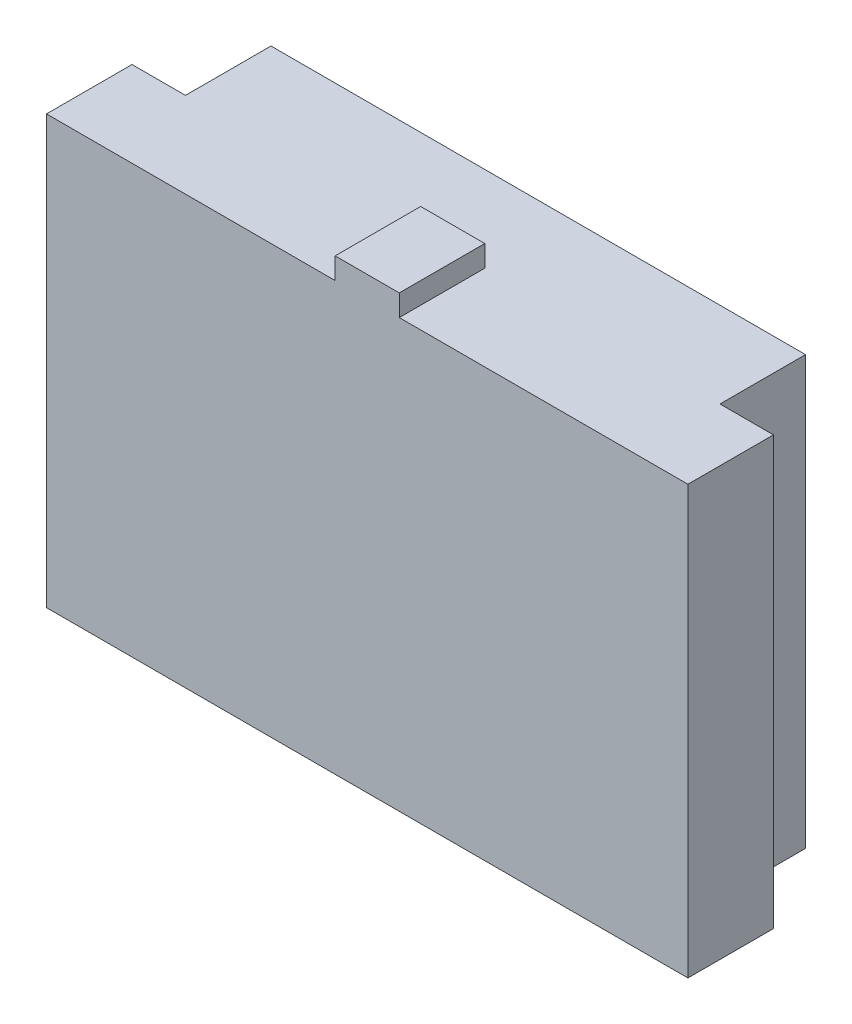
ISO-10303-21;
HEADER;
FILE_DESCRIPTION(('STEP AP214'),'2;1');
FILE_NAME('part.step','',(''),(''),'','','');
FILE_SCHEMA(('AUTOMOTIVE_DESIGN { 1 0 10303 214 1 1 1 1 }'));
ENDSEC;
DATA;
#1=APPLICATION_CONTEXT('core data for automotive mechanical design processes');
#2=APPLICATION_PROTOCOL_DEFINITION('international standard','automotive_design',2000,#1);
#3=PRODUCT_CONTEXT('',#1,'mechanical');
#4=PRODUCT('Part','Part','',(#3));
#5=PRODUCT_RELATED_PRODUCT_CATEGORY('part','',(#4));
#6=PRODUCT_DEFINITION_FORMATION('','',#4);
#7=PRODUCT_DEFINITION_CONTEXT('part definition',#1,'design');
#8=PRODUCT_DEFINITION('design','',#6,#7);
#9=PRODUCT_DEFINITION_SHAPE('','',#8);
#10=(LENGTH_UNIT() NAMED_UNIT(*) SI_UNIT(.MILLI.,.METRE.));
#11=(NAMED_UNIT(*) PLANE_ANGLE_UNIT() SI_UNIT($,.RADIAN.));
#12=(NAMED_UNIT(*) SI_UNIT($,.STERADIAN.) SOLID_ANGLE_UNIT());
#13=UNCERTAINTY_MEASURE_WITH_UNIT(LENGTH_MEASURE(1.E-05),#10,'distance_accuracy_value','');
#14=(GEOMETRIC_REPRESENTATION_CONTEXT(3) GLOBAL_UNCERTAINTY_ASSIGNED_CONTEXT((#13)) GLOBAL_UNIT_ASSIGNED_CONTEXT((#10,
#11,#12)) REPRESENTATION_CONTEXT('',''));
#15=CARTESIAN_POINT('',(0.,0.,0.));
#16=DIRECTION('',(0.,0.,1.));
#17=DIRECTION('',(1.,0.,0.));
#18=AXIS2_PLACEMENT_3D('',#15,#16,#17);
#19=CARTESIAN_POINT('',(0.,0.,0.));
#20=DIRECTION('',(0.,0.,-1.));
#21=DIRECTION('',(-1.,0.,0.));
#22=AXIS2_PLACEMENT_3D('',#19,#20,#21);
#23=PLANE('',#22);
#24=DIRECTION('',(0.,-1.,0.));
#25=VECTOR('',#24,1.);
#26=CARTESIAN_POINT('',(55.,40.,0.));
#27=LINE('',#26,#25);
#28=CARTESIAN_POINT('',(55.,40.,0.));
#29=VERTEX_POINT('',#28);
#30=CARTESIAN_POINT('',(55.,0.,0.));
#31=VERTEX_POINT('',#30);
#32=EDGE_CURVE('E49',#29,#31,#27,.T.);
#33=ORIENTED_EDGE('',*,*,#32,.F.);
#34=DIRECTION('',(-1.,0.,0.));
#35=VECTOR('',#34,1.);
#36=CARTESIAN_POINT('',(60.,40.,0.));
#37=LINE('',#36,#35);
#38=CARTESIAN_POINT('',(60.,40.,0.));
#39=VERTEX_POINT('',#38);
#40=EDGE_CURVE('E172',#39,#29,#37,.T.);
#41=ORIENTED_EDGE('',*,*,#40,.F.);
#42=DIRECTION('',(0.,1.,0.));
#43=VECTOR('',#42,1.);
#44=CARTESIAN_POINT('',(60.,40.,0.));
#45=LINE('',#44,#43);
#46=CARTESIAN_POINT('',(60.,0.,0.));
#47=VERTEX_POINT('',#46);
#48=EDGE_CURVE('E170',#47,#39,#45,.T.);
#49=ORIENTED_EDGE('',*,*,#48,.F.);
#50=DIRECTION('',(1.,0.,0.));
#51=VECTOR('',#50,1.);
#52=CARTESIAN_POINT('',(0.,0.,0.));
#53=LINE('',#52,#51);
#54=EDGE_CURVE('E54',#31,#47,#53,.T.);
#55=ORIENTED_EDGE('',*,*,#54,.F.);
#56=EDGE_LOOP('',(#33,#41,#49,#55));
#57=FACE_BOUND('',#56,.T.);
#58=ADVANCED_FACE('F33',(#57),#23,.T.);
#59=DIRECTION('',(1.,0.,0.));
#60=VECTOR('',#59,1.);
#61=CARTESIAN_POINT('',(55.,40.,0.));
#62=LINE('',#61,#60);
#63=CARTESIAN_POINT('',(27.,40.,0.));
#64=VERTEX_POINT('',#63);
#65=CARTESIAN_POINT('',(33.,40.,0.));
#66=VERTEX_POINT('',#65);
#67=EDGE_CURVE('E11',#64,#66,#62,.T.);
#68=ORIENTED_EDGE('',*,*,#67,.F.);
#69=DIRECTION('',(0.,-1.,0.));
#70=VECTOR('',#69,1.);
#71=CARTESIAN_POINT('',(27.,42.,0.));
#72=LINE('',#71,#70);
#73=CARTESIAN_POINT('',(27.,42.,0.));
#74=VERTEX_POINT('',#73);
#75=EDGE_CURVE('E178',#74,#64,#72,.T.);
#76=ORIENTED_EDGE('',*,*,#75,.F.);
#77=DIRECTION('',(-1.,0.,0.));
#78=VECTOR('',#77,1.);
#79=CARTESIAN_POINT('',(33.,42.,0.));
#80=LINE('',#79,#78);
#81=CARTESIAN_POINT('',(33.,42.,0.));
#82=VERTEX_POINT('',#81);
#83=EDGE_CURVE('E176',#82,#74,#80,.T.);
#84=ORIENTED_EDGE('',*,*,#83,.F.);
#85=DIRECTION('',(0.,1.,0.));
#86=VECTOR('',#85,1.);
#87=CARTESIAN_POINT('',(33.,42.,0.));
#88=LINE('',#87,#86);
#89=EDGE_CURVE('E174',#66,#82,#88,.T.);
#90=ORIENTED_EDGE('',*,*,#89,.F.);
#91=EDGE_LOOP('',(#68,#76,#84,#90));
#92=FACE_BOUND('',#91,.T.);
#93=ADVANCED_FACE('F234',(#92),#23,.T.);
#94=CARTESIAN_POINT('',(0.,0.,8.));
#95=DIRECTION('',(0.,1.,0.));
#96=DIRECTION('',(0.,0.,1.));
#97=AXIS2_PLACEMENT_3D('',#94,#95,#96);
#98=PLANE('',#97);
#99=CARTESIAN_POINT('',(0.,0.,0.));
#100=VERTEX_POINT('',#99);
#101=CARTESIAN_POINT('',(5.,0.,0.));
#102=VERTEX_POINT('',#101);
#103=EDGE_CURVE('E145',#100,#102,#53,.T.);
#104=ORIENTED_EDGE('',*,*,#103,.T.);
#105=DIRECTION('',(0.,0.,1.));
#106=VECTOR('',#105,1.);
#107=CARTESIAN_POINT('',(4.99999999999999,0.,-8.));
#108=LINE('',#107,#106);
#109=CARTESIAN_POINT('',(4.99999999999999,0.,-8.));
#110=VERTEX_POINT('',#109);
#111=EDGE_CURVE('E128',#110,#102,#108,.T.);
#112=ORIENTED_EDGE('',*,*,#111,.F.);
#113=DIRECTION('',(-1.,0.,0.));
#114=VECTOR('',#113,1.);
#115=CARTESIAN_POINT('',(55.,0.,-8.));
#116=LINE('',#115,#114);
#117=CARTESIAN_POINT('',(55.,0.,-8.));
#118=VERTEX_POINT('',#117);
#119=EDGE_CURVE('E122',#118,#110,#116,.T.);
#120=ORIENTED_EDGE('',*,*,#119,.F.);
#121=DIRECTION('',(0.,0.,1.));
#122=VECTOR('',#121,1.);
#123=CARTESIAN_POINT('',(55.,0.,-8.));
#124=LINE('',#123,#122);
#125=EDGE_CURVE('E126',#118,#31,#124,.T.);
#126=ORIENTED_EDGE('',*,*,#125,.T.);
#127=ORIENTED_EDGE('',*,*,#54,.T.);
#128=DIRECTION('',(0.,0.,-1.));
#129=VECTOR('',#128,1.);
#130=CARTESIAN_POINT('',(60.,0.,8.));
#131=LINE('',#130,#129);
#132=CARTESIAN_POINT('',(60.,0.,8.));
#133=VERTEX_POINT('',#132);
#134=EDGE_CURVE('E37',#133,#47,#131,.T.);
#135=ORIENTED_EDGE('',*,*,#134,.F.);
#136=DIRECTION('',(1.,0.,0.));
#137=VECTOR('',#136,1.);
#138=CARTESIAN_POINT('',(0.,0.,8.));
#139=LINE('',#138,#137);
#140=CARTESIAN_POINT('',(0.,0.,8.));
#141=VERTEX_POINT('',#140);
#142=EDGE_CURVE('E151',#141,#133,#139,.T.);
#143=ORIENTED_EDGE('',*,*,#142,.F.);
#144=DIRECTION('',(0.,0.,-1.));
#145=VECTOR('',#144,1.);
#146=CARTESIAN_POINT('',(0.,0.,8.));
#147=LINE('',#146,#145);
#148=EDGE_CURVE('E168',#141,#100,#147,.T.);
#149=ORIENTED_EDGE('',*,*,#148,.T.);
#150=EDGE_LOOP('',(#104,#112,#120,#126,#127,#135,#143,#149));
#151=FACE_BOUND('',#150,.T.);
#152=ADVANCED_FACE('F35',(#151),#98,.F.);
#153=CARTESIAN_POINT('',(60.,40.,8.));
#154=DIRECTION('',(-1.,0.,0.));
#155=DIRECTION('',(0.,-1.,0.));
#156=AXIS2_PLACEMENT_3D('',#153,#154,#155);
#157=PLANE('',#156);
#158=ORIENTED_EDGE('',*,*,#48,.T.);
#159=DIRECTION('',(0.,0.,-1.));
#160=VECTOR('',#159,1.);
#161=CARTESIAN_POINT('',(60.,40.,8.));
#162=LINE('',#161,#160);
#163=CARTESIAN_POINT('',(60.,40.,8.));
#164=VERTEX_POINT('',#163);
#165=EDGE_CURVE('E199',#164,#39,#162,.T.);
#166=ORIENTED_EDGE('',*,*,#165,.F.);
#167=DIRECTION('',(0.,1.,0.));
#168=VECTOR('',#167,1.);
#169=CARTESIAN_POINT('',(60.,40.,8.));
#170=LINE('',#169,#168);
#171=EDGE_CURVE('E154',#133,#164,#170,.T.);
#172=ORIENTED_EDGE('',*,*,#171,.F.);
#173=ORIENTED_EDGE('',*,*,#134,.T.);
#174=EDGE_LOOP('',(#158,#166,#172,#173));
#175=FACE_BOUND('',#174,.T.);
#176=ADVANCED_FACE('F207',(#175),#157,.F.);
#177=CARTESIAN_POINT('',(33.,42.,8.));
#178=DIRECTION('',(-1.,0.,0.));
#179=DIRECTION('',(0.,-1.,0.));
#180=AXIS2_PLACEMENT_3D('',#177,#178,#179);
#181=PLANE('',#180);
#182=ORIENTED_EDGE('',*,*,#89,.T.);
#183=DIRECTION('',(0.,0.,-1.));
#184=VECTOR('',#183,1.);
#185=CARTESIAN_POINT('',(33.,42.,8.));
#186=LINE('',#185,#184);
#187=CARTESIAN_POINT('',(33.,42.,8.));
#188=VERTEX_POINT('',#187);
#189=EDGE_CURVE('E195',#188,#82,#186,.T.);
#190=ORIENTED_EDGE('',*,*,#189,.F.);
#191=DIRECTION('',(0.,1.,0.));
#192=VECTOR('',#191,1.);
#193=CARTESIAN_POINT('',(33.,42.,8.));
#194=LINE('',#193,#192);
#195=CARTESIAN_POINT('',(33.,40.,8.));
#196=VERTEX_POINT('',#195);
#197=EDGE_CURVE('E159',#196,#188,#194,.T.);
#198=ORIENTED_EDGE('',*,*,#197,.F.);
#199=DIRECTION('',(0.,0.,-1.));
#200=VECTOR('',#199,1.);
#201=CARTESIAN_POINT('',(33.,40.,8.));
#202=LINE('',#201,#200);
#203=EDGE_CURVE('E198',#196,#66,#202,.T.);
#204=ORIENTED_EDGE('',*,*,#203,.T.);
#205=EDGE_LOOP('',(#182,#190,#198,#204));
#206=FACE_BOUND('',#205,.T.);
#207=ADVANCED_FACE('F264',(#206),#181,.F.);
#208=CARTESIAN_POINT('',(33.,42.,8.));
#209=DIRECTION('',(0.,-1.,0.));
#210=DIRECTION('',(0.,0.,-1.));
#211=AXIS2_PLACEMENT_3D('',#208,#209,#210);
#212=PLANE('',#211);
#213=ORIENTED_EDGE('',*,*,#83,.T.);
#214=DIRECTION('',(0.,0.,-1.));
#215=VECTOR('',#214,1.);
#216=CARTESIAN_POINT('',(27.,42.,8.));
#217=LINE('',#216,#215);
#218=CARTESIAN_POINT('',(27.,42.,8.));
#219=VERTEX_POINT('',#218);
#220=EDGE_CURVE('E192',#219,#74,#217,.T.);
#221=ORIENTED_EDGE('',*,*,#220,.F.);
#222=DIRECTION('',(-1.,0.,0.));
#223=VECTOR('',#222,1.);
#224=CARTESIAN_POINT('',(33.,42.,8.));
#225=LINE('',#224,#223);
#226=EDGE_CURVE('E161',#188,#219,#225,.T.);
#227=ORIENTED_EDGE('',*,*,#226,.F.);
#228=ORIENTED_EDGE('',*,*,#189,.T.);
#229=EDGE_LOOP('',(#213,#221,#227,#228));
#230=FACE_BOUND('',#229,.T.);
#231=ADVANCED_FACE('F262',(#230),#212,.F.);
#232=CARTESIAN_POINT('',(27.,42.,8.));
#233=DIRECTION('',(1.,0.,0.));
#234=DIRECTION('',(0.,1.,0.));
#235=AXIS2_PLACEMENT_3D('',#232,#233,#234);
#236=PLANE('',#235);
#237=ORIENTED_EDGE('',*,*,#75,.T.);
#238=DIRECTION('',(0.,0.,-1.));
#239=VECTOR('',#238,1.);
#240=CARTESIAN_POINT('',(27.,40.,8.));
#241=LINE('',#240,#239);
#242=CARTESIAN_POINT('',(27.,40.,8.));
#243=VERTEX_POINT('',#242);
#244=EDGE_CURVE('E189',#243,#64,#241,.T.);
#245=ORIENTED_EDGE('',*,*,#244,.F.);
#246=DIRECTION('',(0.,-1.,0.));
#247=VECTOR('',#246,1.);
#248=CARTESIAN_POINT('',(27.,42.,8.));
#249=LINE('',#248,#247);
#250=EDGE_CURVE('E163',#219,#243,#249,.T.);
#251=ORIENTED_EDGE('',*,*,#250,.F.);
#252=ORIENTED_EDGE('',*,*,#220,.T.);
#253=EDGE_LOOP('',(#237,#245,#251,#252));
#254=FACE_BOUND('',#253,.T.);
#255=ADVANCED_FACE('F255',(#254),#236,.F.);
#256=CARTESIAN_POINT('',(0.,40.,8.));
#257=DIRECTION('',(0.,-1.,0.));
#258=DIRECTION('',(0.,0.,-1.));
#259=AXIS2_PLACEMENT_3D('',#256,#257,#258);
#260=PLANE('',#259);
#261=ORIENTED_EDGE('',*,*,#244,.T.);
#262=ORIENTED_EDGE('',*,*,#67,.T.);
#263=ORIENTED_EDGE('',*,*,#203,.F.);
#264=DIRECTION('',(-1.,0.,0.));
#265=VECTOR('',#264,1.);
#266=CARTESIAN_POINT('',(60.,40.,8.));
#267=LINE('',#266,#265);
#268=EDGE_CURVE('E157',#164,#196,#267,.T.);
#269=ORIENTED_EDGE('',*,*,#268,.F.);
#270=ORIENTED_EDGE('',*,*,#165,.T.);
#271=ORIENTED_EDGE('',*,*,#40,.T.);
#272=DIRECTION('',(0.,0.,1.));
#273=VECTOR('',#272,1.);
#274=CARTESIAN_POINT('',(55.,40.,-8.));
#275=LINE('',#274,#273);
#276=CARTESIAN_POINT('',(55.,40.,-8.));
#277=VERTEX_POINT('',#276);
#278=EDGE_CURVE('E210',#277,#29,#275,.T.);
#279=ORIENTED_EDGE('',*,*,#278,.F.);
#280=DIRECTION('',(1.,0.,0.));
#281=VECTOR('',#280,1.);
#282=CARTESIAN_POINT('',(55.,40.,-8.));
#283=LINE('',#282,#281);
#284=CARTESIAN_POINT('',(5.,40.,-8.));
#285=VERTEX_POINT('',#284);
#286=EDGE_CURVE('E137',#285,#277,#283,.T.);
#287=ORIENTED_EDGE('',*,*,#286,.F.);
#288=DIRECTION('',(0.,0.,1.));
#289=VECTOR('',#288,1.);
#290=CARTESIAN_POINT('',(5.,40.,-8.));
#291=LINE('',#290,#289);
#292=CARTESIAN_POINT('',(5.,40.,0.));
#293=VERTEX_POINT('',#292);
#294=EDGE_CURVE('E147',#285,#293,#291,.T.);
#295=ORIENTED_EDGE('',*,*,#294,.T.);
#296=DIRECTION('',(-1.,0.,0.));
#297=VECTOR('',#296,1.);
#298=CARTESIAN_POINT('',(0.,40.,0.));
#299=LINE('',#298,#297);
#300=CARTESIAN_POINT('',(0.,40.,0.));
#301=VERTEX_POINT('',#300);
#302=EDGE_CURVE('E181',#293,#301,#299,.T.);
#303=ORIENTED_EDGE('',*,*,#302,.T.);
#304=DIRECTION('',(0.,0.,-1.));
#305=VECTOR('',#304,1.);
#306=CARTESIAN_POINT('',(0.,40.,8.));
#307=LINE('',#306,#305);
#308=CARTESIAN_POINT('',(0.,40.,8.));
#309=VERTEX_POINT('',#308);
#310=EDGE_CURVE('E186',#309,#301,#307,.T.);
#311=ORIENTED_EDGE('',*,*,#310,.F.);
#312=DIRECTION('',(-1.,0.,0.));
#313=VECTOR('',#312,1.);
#314=CARTESIAN_POINT('',(0.,40.,8.));
#315=LINE('',#314,#313);
#316=EDGE_CURVE('E165',#243,#309,#315,.T.);
#317=ORIENTED_EDGE('',*,*,#316,.F.);
#318=EDGE_LOOP('',(#261,#262,#263,#269,#270,#271,#279,#287,#295,#303,#311,#317));
#319=FACE_BOUND('',#318,.T.);
#320=ADVANCED_FACE('F209',(#319),#260,.F.);
#321=CARTESIAN_POINT('',(0.,40.,8.));
#322=DIRECTION('',(1.,0.,0.));
#323=DIRECTION('',(0.,1.,0.));
#324=AXIS2_PLACEMENT_3D('',#321,#322,#323);
#325=PLANE('',#324);
#326=DIRECTION('',(0.,-1.,0.));
#327=VECTOR('',#326,1.);
#328=CARTESIAN_POINT('',(0.,40.,0.));
#329=LINE('',#328,#327);
#330=EDGE_CURVE('E155',#301,#100,#329,.T.);
#331=ORIENTED_EDGE('',*,*,#330,.T.);
#332=ORIENTED_EDGE('',*,*,#148,.F.);
#333=DIRECTION('',(0.,-1.,0.));
#334=VECTOR('',#333,1.);
#335=CARTESIAN_POINT('',(0.,40.,8.));
#336=LINE('',#335,#334);
#337=EDGE_CURVE('E167',#309,#141,#336,.T.);
#338=ORIENTED_EDGE('',*,*,#337,.F.);
#339=ORIENTED_EDGE('',*,*,#310,.T.);
#340=EDGE_LOOP('',(#331,#332,#338,#339));
#341=FACE_BOUND('',#340,.T.);
#342=ADVANCED_FACE('F227',(#341),#325,.F.);
#343=CARTESIAN_POINT('',(0.,0.,8.));
#344=DIRECTION('',(0.,0.,-1.));
#345=DIRECTION('',(-1.,0.,0.));
#346=AXIS2_PLACEMENT_3D('',#343,#344,#345);
#347=PLANE('',#346);
#348=ORIENTED_EDGE('',*,*,#142,.T.);
#349=ORIENTED_EDGE('',*,*,#171,.T.);
#350=ORIENTED_EDGE('',*,*,#268,.T.);
#351=ORIENTED_EDGE('',*,*,#197,.T.);
#352=ORIENTED_EDGE('',*,*,#226,.T.);
#353=ORIENTED_EDGE('',*,*,#250,.T.);
#354=ORIENTED_EDGE('',*,*,#316,.T.);
#355=ORIENTED_EDGE('',*,*,#337,.T.);
#356=EDGE_LOOP('',(#348,#349,#350,#351,#352,#353,#354,#355));
#357=FACE_BOUND('',#356,.T.);
#358=ADVANCED_FACE('F232',(#357),#347,.F.);
#359=DIRECTION('',(0.,1.,0.));
#360=VECTOR('',#359,1.);
#361=CARTESIAN_POINT('',(5.,40.,0.));
#362=LINE('',#361,#360);
#363=EDGE_CURVE('E141',#102,#293,#362,.T.);
#364=ORIENTED_EDGE('',*,*,#363,.F.);
#365=ORIENTED_EDGE('',*,*,#103,.F.);
#366=ORIENTED_EDGE('',*,*,#330,.F.);
#367=ORIENTED_EDGE('',*,*,#302,.F.);
#368=EDGE_LOOP('',(#364,#365,#366,#367));
#369=FACE_BOUND('',#368,.T.);
#370=ADVANCED_FACE('F230',(#369),#23,.T.);
#371=CARTESIAN_POINT('',(55.,40.,-8.));
#372=DIRECTION('',(-1.,0.,0.));
#373=DIRECTION('',(0.,-1.,0.));
#374=AXIS2_PLACEMENT_3D('',#371,#372,#373);
#375=PLANE('',#374);
#376=ORIENTED_EDGE('',*,*,#32,.T.);
#377=ORIENTED_EDGE('',*,*,#125,.F.);
#378=DIRECTION('',(0.,-1.,0.));
#379=VECTOR('',#378,1.);
#380=CARTESIAN_POINT('',(55.,40.,-8.));
#381=LINE('',#380,#379);
#382=EDGE_CURVE('E132',#277,#118,#381,.T.);
#383=ORIENTED_EDGE('',*,*,#382,.F.);
#384=ORIENTED_EDGE('',*,*,#278,.T.);
#385=EDGE_LOOP('',(#376,#377,#383,#384));
#386=FACE_BOUND('',#385,.T.);
#387=ADVANCED_FACE('F143',(#386),#375,.F.);
#388=CARTESIAN_POINT('',(5.,40.,-8.));
#389=DIRECTION('',(1.,0.,0.));
#390=DIRECTION('',(0.,1.,0.));
#391=AXIS2_PLACEMENT_3D('',#388,#389,#390);
#392=PLANE('',#391);
#393=ORIENTED_EDGE('',*,*,#363,.T.);
#394=ORIENTED_EDGE('',*,*,#294,.F.);
#395=DIRECTION('',(0.,1.,0.));
#396=VECTOR('',#395,1.);
#397=CARTESIAN_POINT('',(5.,40.,-8.));
#398=LINE('',#397,#396);
#399=EDGE_CURVE('E131',#110,#285,#398,.T.);
#400=ORIENTED_EDGE('',*,*,#399,.F.);
#401=ORIENTED_EDGE('',*,*,#111,.T.);
#402=EDGE_LOOP('',(#393,#394,#400,#401));
#403=FACE_BOUND('',#402,.T.);
#404=ADVANCED_FACE('F220',(#403),#392,.F.);
#405=CARTESIAN_POINT('',(0.,0.,-8.));
#406=DIRECTION('',(0.,0.,-1.));
#407=DIRECTION('',(-1.,0.,0.));
#408=AXIS2_PLACEMENT_3D('',#405,#406,#407);
#409=PLANE('',#408);
#410=ORIENTED_EDGE('',*,*,#382,.T.);
#411=ORIENTED_EDGE('',*,*,#119,.T.);
#412=ORIENTED_EDGE('',*,*,#399,.T.);
#413=ORIENTED_EDGE('',*,*,#286,.T.);
#414=EDGE_LOOP('',(#410,#411,#412,#413));
#415=FACE_BOUND('',#414,.T.);
#416=ADVANCED_FACE('F135',(#415),#409,.T.);
#417=CLOSED_SHELL('',(#58,#93,#152,#176,#207,#231,#255,#320,#342,#358,#370,#387,#404,#416));
#418=MANIFOLD_SOLID_BREP('B2',#417);
#419=ADVANCED_BREP_SHAPE_REPRESENTATION('',(#18,#418),#14);
#420=SHAPE_DEFINITION_REPRESENTATION(#9,#419);
ENDSEC;
END-ISO-10303-21;
